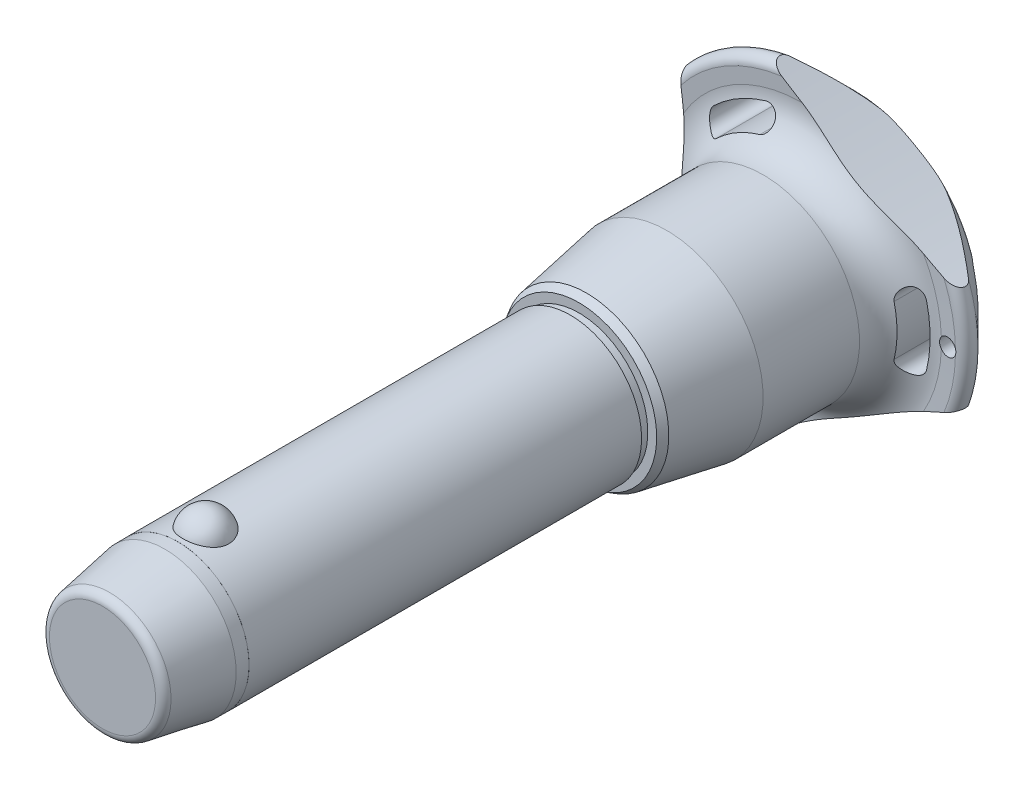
from build123d import *

# Parameters (mm, degrees)
SKETCH1_R           = 12.5
BOSS_EXTRUDE1_DEPTH = 60
SKETCH2_R           = 10
BOSS_EXTRUDE2_DEPTH = 50.7
BOSS_EXTRUDE3_START = 22
SKETCH1_2_R         = 12.5
BOSS_EXTRUDE3_DEPTH = 22
CHAMFER1_SIZE       = 11
CHAMFER1_SIZE2      = 1.939596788
FILLET1_R           = 1.5
SKETCH6_R           = 176.92625
CUT_EXTRUDE1_DEPTH  = 118.833791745
CIRPATTERN1_COUNT   = 3
SKETCH7_R           = 1.5
CUT_EXTRUDE2_DEPTH  = 118.704532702
SKETCH8_R           = 12.5
SKETCH8_R_2         = 12.49
CUT_EXTRUDE3_DEPTH  = 13.2


with BuildPart() as part:
    # Sketch1 → Boss-Extrude1 (new body)
    with BuildSketch(Plane.XY):
        Circle(SKETCH1_R)
    extrude(amount=-BOSS_EXTRUDE1_DEPTH)

    # Sketch2 → Boss-Extrude2 (add)
    with BuildSketch(Plane(origin=(0, 0, -60), x_dir=(-1, 0, 0), z_dir=(0, 0, -1))):
        with Locations(Location((0, 0, 0), (0, 0, 180))):
            Circle(SKETCH2_R)
    extrude(amount=BOSS_EXTRUDE2_DEPTH)

    # Sketch3 → Revolve1 (revolve)
    with BuildSketch(Plane(origin=(0, 0, 0), x_dir=(0, 0, -1), z_dir=(1, 0, 0))):
        with BuildLine():
            Line((-3.957271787, 15.4), (-3.957271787, 7.1))
            ThreePointArc((-3.957271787, 7.1), (0.192728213, 11.25), (-3.957271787, 15.4))
        make_face()
        with BuildLine():
            Line((-3.957271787, -7.1), (-3.957271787, -15.4))
            ThreePointArc((-3.957271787, -15.4), (0.192728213, -11.25), (-3.957271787, -7.1))
        make_face()
    revolve(axis=Axis((0, -7.1, 3.957271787), (0, 1, 0)))

    # Sketch1_2 → Boss-Extrude3 (add)
    with BuildSketch(Plane.XY.offset(BOSS_EXTRUDE3_START)):
        Circle(SKETCH1_2_R)
    extrude(amount=-BOSS_EXTRUDE3_DEPTH)

    # Chamfer1
    chamfer1_edges = [part.edges().sort_by_distance(p)[0] for p in [
        (-12.5, 0, 22),
    ]]
    chamfer1_side = [part.faces().sort_by_distance(p)[0] for p in [
        (-12.5, 0, -19),
    ]]
    chamfer(chamfer1_edges, length=CHAMFER1_SIZE, length2=CHAMFER1_SIZE2, reference=chamfer1_side[0])

    # Fillet1
    fillet1_edges = [part.edges().sort_by_distance(p)[0] for p in [
        (-10.560403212, 0, 22),
        (-10, 0, -110.7),
    ]]
    fillet(fillet1_edges, radius=FILLET1_R)

    # Sketch4 → Revolve2 (revolve)
    with BuildSketch(Plane(origin=(0, 0, 0), x_dir=(0, 0, -1), z_dir=(1, 0, 0)), mode=Mode.PRIVATE) as revolve2_sk:
        Polygon((60, 0), (60, 12.089202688), (61.5, 12.089202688), (61.5, 13.644437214), (62.846872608, 14.422054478), (76.9, 16.9), (93.8, 16.9), (93.8, 0), align=None)
    revolve(revolve2_sk.sketch.rotate(Axis((0, 0, -93.8), (0, 0, 1)), 90), axis=Axis((0, 0, -93.8), (0, 0, 1)))

    # Sketch5 → Revolve3 (revolve)
    with BuildSketch(Plane(origin=(0, 0, 0), x_dir=(0, 0, -1), z_dir=(1, 0, 0)), mode=Mode.PRIVATE) as revolve3_sk:
        with BuildLine():
            Line((100.790129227, 24.271609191), (100.652256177, 26.865060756))
            ThreePointArc((100.652256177, 26.865060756), (101.598671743, 28.411427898), (103.38137085, 28.08137085))
            Line((103.38137085, 28.08137085), (109.763226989, 21.69951471))
            ThreePointArc((109.763226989, 21.69951471), (110.7, 19.381044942), (109.683055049, 17.096604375))
            ThreePointArc((109.683055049, 17.096604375), (104.18864484, 9.321268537), (102.25, 0))
            Line((102.25, 0), (93.8, 0))
            Line((93.8, 0), (93.8, 16.9))
            ThreePointArc((93.8, 16.9), (98.879432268, 19.083427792), (100.790129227, 24.271609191))
        make_face()
    revolve(revolve3_sk.sketch.rotate(Axis((0, 0, -102.25), (0, 0, 1)), 90), axis=Axis((0, 0, -102.25), (0, 0, 1)))

    # Sketch6 → Cut-Extrude1 (cut, through all)
    with BuildSketch(Plane.XY):
        with Locations((-197.42625, 0)):
            Circle(SKETCH6_R)
        with BuildLine():
            ThreePointArc((21.802992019, -5.260839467), (22.428706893, 0), (21.802992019, 5.260839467))
            ThreePointArc((21.802992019, 5.260839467), (19.579234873, 6.620060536), (18.220013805, 4.39630339))
            ThreePointArc((18.220013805, 4.39630339), (18.742902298, 0), (18.220013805, -4.39630339))
            ThreePointArc((18.220013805, -4.39630339), (19.579234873, -6.620060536), (21.802992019, -5.260839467))
        make_face()
    cut_extrude1 = extrude(amount=-CUT_EXTRUDE1_DEPTH, mode=Mode.SUBTRACT)

    # CirPattern1: Cut-Extrude1 ×3 about axis
    cirpattern1_axis = Axis((0, 0, 0), (0, 0, 1))
    for i in range(1, CIRPATTERN1_COUNT):
        add(cut_extrude1.rotate(cirpattern1_axis, i * 360 / CIRPATTERN1_COUNT), mode=Mode.SUBTRACT)

    # Sketch7 → Cut-Extrude2 (cut, through all)
    with BuildSketch(Plane.XY):
        with Locations(Location((25.428706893, 0, 0), (0, 0, 17.230769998))):
            Circle(SKETCH7_R)
    extrude(amount=-CUT_EXTRUDE2_DEPTH, mode=Mode.SUBTRACT)

    # Sketch8 → Cut-Extrude3 (cut)
    with BuildSketch(Plane.XY.offset(22)):
        Circle(SKETCH8_R)
        Circle(SKETCH8_R_2, mode=Mode.SUBTRACT)
    extrude(amount=-CUT_EXTRUDE3_DEPTH, mode=Mode.SUBTRACT)


solid = part.part
